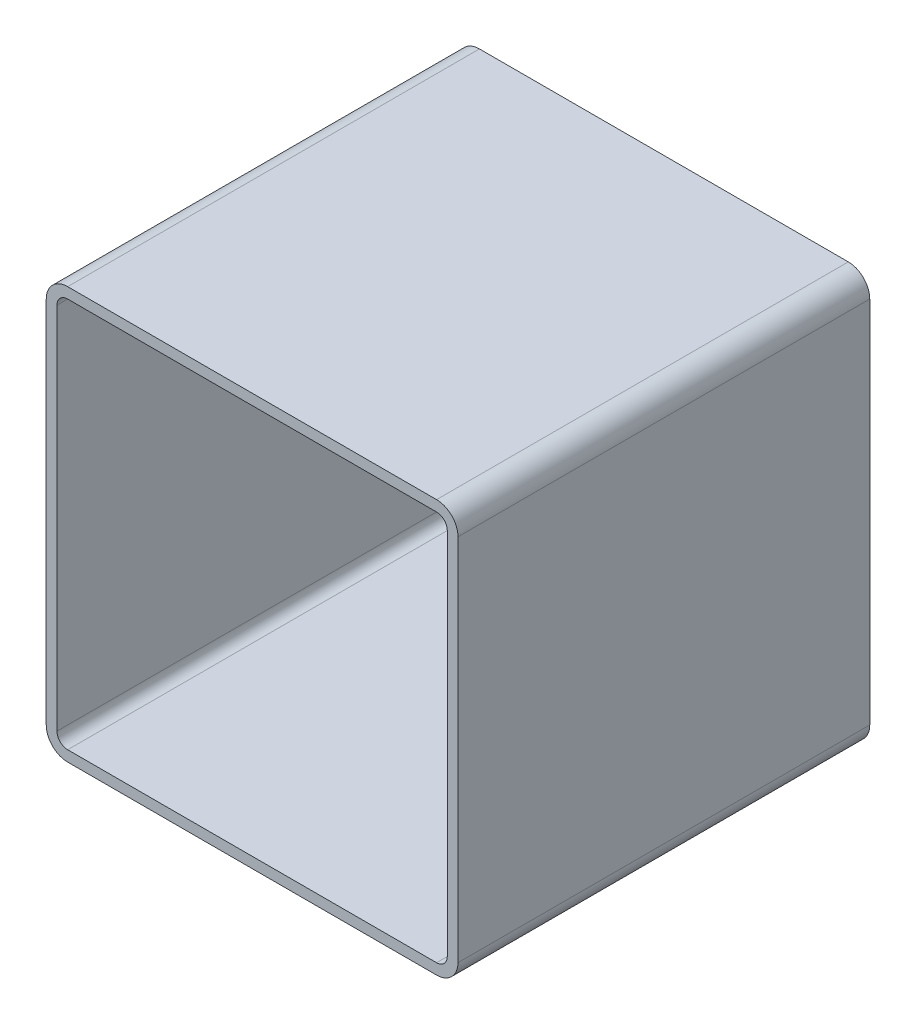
ISO-10303-21;
HEADER;
FILE_DESCRIPTION(('STEP AP214'),'2;1');
FILE_NAME('part.step','',(''),(''),'','','');
FILE_SCHEMA(('AUTOMOTIVE_DESIGN { 1 0 10303 214 1 1 1 1 }'));
ENDSEC;
DATA;
#1=APPLICATION_CONTEXT('core data for automotive mechanical design processes');
#2=APPLICATION_PROTOCOL_DEFINITION('international standard','automotive_design',2000,#1);
#3=PRODUCT_CONTEXT('',#1,'mechanical');
#4=PRODUCT('Part','Part','',(#3));
#5=PRODUCT_RELATED_PRODUCT_CATEGORY('part','',(#4));
#6=PRODUCT_DEFINITION_FORMATION('','',#4);
#7=PRODUCT_DEFINITION_CONTEXT('part definition',#1,'design');
#8=PRODUCT_DEFINITION('design','',#6,#7);
#9=PRODUCT_DEFINITION_SHAPE('','',#8);
#10=(LENGTH_UNIT() NAMED_UNIT(*) SI_UNIT(.MILLI.,.METRE.));
#11=(NAMED_UNIT(*) PLANE_ANGLE_UNIT() SI_UNIT($,.RADIAN.));
#12=(NAMED_UNIT(*) SI_UNIT($,.STERADIAN.) SOLID_ANGLE_UNIT());
#13=UNCERTAINTY_MEASURE_WITH_UNIT(LENGTH_MEASURE(1.E-05),#10,'distance_accuracy_value','');
#14=(GEOMETRIC_REPRESENTATION_CONTEXT(3) GLOBAL_UNCERTAINTY_ASSIGNED_CONTEXT((#13)) GLOBAL_UNIT_ASSIGNED_CONTEXT((#10,
#11,#12)) REPRESENTATION_CONTEXT('',''));
#15=CARTESIAN_POINT('',(0.,0.,0.));
#16=DIRECTION('',(0.,0.,1.));
#17=DIRECTION('',(1.,0.,0.));
#18=AXIS2_PLACEMENT_3D('',#15,#16,#17);
#19=CARTESIAN_POINT('',(16.9817030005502,290.799496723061,304.8));
#20=DIRECTION('',(0.,0.,1.));
#21=DIRECTION('',(1.,0.,0.));
#22=AXIS2_PLACEMENT_3D('',#19,#20,#21);
#23=PLANE('',#22);
#24=CARTESIAN_POINT('',(16.9817030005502,290.799496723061,304.8));
#25=DIRECTION('',(0.,0.,1.));
#26=DIRECTION('',(1.,0.,0.));
#27=AXIS2_PLACEMENT_3D('',#24,#25,#26);
#28=CIRCLE('',#27,15.875);
#29=CARTESIAN_POINT('',(16.9817030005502,306.674496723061,304.8));
#30=VERTEX_POINT('',#29);
#31=CARTESIAN_POINT('',(1.10670300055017,290.799496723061,304.8));
#32=VERTEX_POINT('',#31);
#33=EDGE_CURVE('E211',#30,#32,#28,.T.);
#34=ORIENTED_EDGE('',*,*,#33,.T.);
#35=DIRECTION('',(0.,-1.,0.));
#36=VECTOR('',#35,1.);
#37=CARTESIAN_POINT('',(1.10670300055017,17.7494967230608,304.8));
#38=LINE('',#37,#36);
#39=CARTESIAN_POINT('',(1.10670300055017,17.7494967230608,304.8));
#40=VERTEX_POINT('',#39);
#41=EDGE_CURVE('E214',#32,#40,#38,.T.);
#42=ORIENTED_EDGE('',*,*,#41,.T.);
#43=CARTESIAN_POINT('',(16.9817030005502,17.7494967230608,304.8));
#44=DIRECTION('',(0.,0.,1.));
#45=DIRECTION('',(1.,0.,0.));
#46=AXIS2_PLACEMENT_3D('',#43,#44,#45);
#47=CIRCLE('',#46,15.875);
#48=CARTESIAN_POINT('',(16.9817030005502,1.87449672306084,304.8));
#49=VERTEX_POINT('',#48);
#50=EDGE_CURVE('E217',#40,#49,#47,.T.);
#51=ORIENTED_EDGE('',*,*,#50,.T.);
#52=DIRECTION('',(1.,0.,0.));
#53=VECTOR('',#52,1.);
#54=CARTESIAN_POINT('',(290.03170300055,1.87449672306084,304.8));
#55=LINE('',#54,#53);
#56=CARTESIAN_POINT('',(290.03170300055,1.87449672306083,304.8));
#57=VERTEX_POINT('',#56);
#58=EDGE_CURVE('E219',#49,#57,#55,.T.);
#59=ORIENTED_EDGE('',*,*,#58,.T.);
#60=CARTESIAN_POINT('',(290.03170300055,17.7494967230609,304.8));
#61=DIRECTION('',(0.,0.,1.));
#62=DIRECTION('',(1.,0.,0.));
#63=AXIS2_PLACEMENT_3D('',#60,#61,#62);
#64=CIRCLE('',#63,15.875);
#65=CARTESIAN_POINT('',(305.90670300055,17.7494967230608,304.8));
#66=VERTEX_POINT('',#65);
#67=EDGE_CURVE('E221',#57,#66,#64,.T.);
#68=ORIENTED_EDGE('',*,*,#67,.T.);
#69=DIRECTION('',(0.,1.,0.));
#70=VECTOR('',#69,1.);
#71=CARTESIAN_POINT('',(305.90670300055,290.799496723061,304.8));
#72=LINE('',#71,#70);
#73=CARTESIAN_POINT('',(305.90670300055,290.799496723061,304.8));
#74=VERTEX_POINT('',#73);
#75=EDGE_CURVE('E223',#66,#74,#72,.T.);
#76=ORIENTED_EDGE('',*,*,#75,.T.);
#77=CARTESIAN_POINT('',(290.03170300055,290.799496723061,304.8));
#78=DIRECTION('',(0.,0.,1.));
#79=DIRECTION('',(1.,0.,0.));
#80=AXIS2_PLACEMENT_3D('',#77,#78,#79);
#81=CIRCLE('',#80,15.875);
#82=CARTESIAN_POINT('',(290.03170300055,306.674496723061,304.8));
#83=VERTEX_POINT('',#82);
#84=EDGE_CURVE('E225',#74,#83,#81,.T.);
#85=ORIENTED_EDGE('',*,*,#84,.T.);
#86=DIRECTION('',(-1.,0.,0.));
#87=VECTOR('',#86,1.);
#88=CARTESIAN_POINT('',(16.9817030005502,306.674496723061,304.8));
#89=LINE('',#88,#87);
#90=EDGE_CURVE('E227',#83,#30,#89,.T.);
#91=ORIENTED_EDGE('',*,*,#90,.T.);
#92=EDGE_LOOP('',(#34,#42,#51,#59,#68,#76,#85,#91));
#93=FACE_BOUND('',#92,.T.);
#94=DIRECTION('',(0.,-1.,0.));
#95=VECTOR('',#94,1.);
#96=CARTESIAN_POINT('',(9.04420300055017,17.7494967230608,304.8));
#97=LINE('',#96,#95);
#98=CARTESIAN_POINT('',(9.04420300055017,290.799496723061,304.8));
#99=VERTEX_POINT('',#98);
#100=CARTESIAN_POINT('',(9.04420300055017,17.7494967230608,304.8));
#101=VERTEX_POINT('',#100);
#102=EDGE_CURVE('E154',#99,#101,#97,.T.);
#103=ORIENTED_EDGE('',*,*,#102,.F.);
#104=CARTESIAN_POINT('',(16.9817030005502,290.799496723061,304.8));
#105=DIRECTION('',(0.,0.,1.));
#106=DIRECTION('',(1.,0.,0.));
#107=AXIS2_PLACEMENT_3D('',#104,#105,#106);
#108=CIRCLE('',#107,7.9375);
#109=CARTESIAN_POINT('',(16.9817030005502,298.736996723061,304.8));
#110=VERTEX_POINT('',#109);
#111=EDGE_CURVE('E146',#110,#99,#108,.T.);
#112=ORIENTED_EDGE('',*,*,#111,.F.);
#113=DIRECTION('',(-1.,0.,0.));
#114=VECTOR('',#113,1.);
#115=CARTESIAN_POINT('',(16.9817030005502,298.736996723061,304.8));
#116=LINE('',#115,#114);
#117=CARTESIAN_POINT('',(290.03170300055,298.736996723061,304.8));
#118=VERTEX_POINT('',#117);
#119=EDGE_CURVE('E179',#118,#110,#116,.T.);
#120=ORIENTED_EDGE('',*,*,#119,.F.);
#121=CARTESIAN_POINT('',(290.03170300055,290.799496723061,304.8));
#122=DIRECTION('',(0.,0.,1.));
#123=DIRECTION('',(1.,0.,0.));
#124=AXIS2_PLACEMENT_3D('',#121,#122,#123);
#125=CIRCLE('',#124,7.93750000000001);
#126=CARTESIAN_POINT('',(297.96920300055,290.799496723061,304.8));
#127=VERTEX_POINT('',#126);
#128=EDGE_CURVE('E177',#127,#118,#125,.T.);
#129=ORIENTED_EDGE('',*,*,#128,.F.);
#130=DIRECTION('',(0.,1.,0.));
#131=VECTOR('',#130,1.);
#132=CARTESIAN_POINT('',(297.96920300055,290.799496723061,304.8));
#133=LINE('',#132,#131);
#134=CARTESIAN_POINT('',(297.96920300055,17.7494967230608,304.8));
#135=VERTEX_POINT('',#134);
#136=EDGE_CURVE('E175',#135,#127,#133,.T.);
#137=ORIENTED_EDGE('',*,*,#136,.F.);
#138=CARTESIAN_POINT('',(290.03170300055,17.7494967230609,304.8));
#139=DIRECTION('',(0.,0.,1.));
#140=DIRECTION('',(1.,0.,0.));
#141=AXIS2_PLACEMENT_3D('',#138,#139,#140);
#142=CIRCLE('',#141,7.93750000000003);
#143=CARTESIAN_POINT('',(290.03170300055,9.81199672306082,304.8));
#144=VERTEX_POINT('',#143);
#145=EDGE_CURVE('E173',#144,#135,#142,.T.);
#146=ORIENTED_EDGE('',*,*,#145,.F.);
#147=DIRECTION('',(1.,0.,0.));
#148=VECTOR('',#147,1.);
#149=CARTESIAN_POINT('',(290.03170300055,9.81199672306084,304.8));
#150=LINE('',#149,#148);
#151=CARTESIAN_POINT('',(16.9817030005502,9.81199672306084,304.8));
#152=VERTEX_POINT('',#151);
#153=EDGE_CURVE('E169',#152,#144,#150,.T.);
#154=ORIENTED_EDGE('',*,*,#153,.F.);
#155=CARTESIAN_POINT('',(16.9817030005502,17.7494967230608,304.8));
#156=DIRECTION('',(0.,0.,1.));
#157=DIRECTION('',(1.,0.,0.));
#158=AXIS2_PLACEMENT_3D('',#155,#156,#157);
#159=CIRCLE('',#158,7.9375);
#160=EDGE_CURVE('E167',#101,#152,#159,.T.);
#161=ORIENTED_EDGE('',*,*,#160,.F.);
#162=EDGE_LOOP('',(#103,#112,#120,#129,#137,#146,#154,#161));
#163=FACE_BOUND('',#162,.T.);
#164=ADVANCED_FACE('F33',(#93,#163),#23,.T.);
#165=CARTESIAN_POINT('',(16.9817030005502,290.799496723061,0.));
#166=DIRECTION('',(0.,0.,1.));
#167=DIRECTION('',(1.,0.,0.));
#168=AXIS2_PLACEMENT_3D('',#165,#166,#167);
#169=PLANE('',#168);
#170=CARTESIAN_POINT('',(16.9817030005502,290.799496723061,0.));
#171=DIRECTION('',(0.,0.,1.));
#172=DIRECTION('',(1.,0.,0.));
#173=AXIS2_PLACEMENT_3D('',#170,#171,#172);
#174=CIRCLE('',#173,15.875);
#175=CARTESIAN_POINT('',(16.9817030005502,306.674496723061,0.));
#176=VERTEX_POINT('',#175);
#177=CARTESIAN_POINT('',(1.10670300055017,290.799496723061,0.));
#178=VERTEX_POINT('',#177);
#179=EDGE_CURVE('E162',#176,#178,#174,.T.);
#180=ORIENTED_EDGE('',*,*,#179,.F.);
#181=DIRECTION('',(-1.,0.,0.));
#182=VECTOR('',#181,1.);
#183=CARTESIAN_POINT('',(16.9817030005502,306.674496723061,0.));
#184=LINE('',#183,#182);
#185=CARTESIAN_POINT('',(290.03170300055,306.674496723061,0.));
#186=VERTEX_POINT('',#185);
#187=EDGE_CURVE('E215',#186,#176,#184,.T.);
#188=ORIENTED_EDGE('',*,*,#187,.F.);
#189=CARTESIAN_POINT('',(290.03170300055,290.799496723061,0.));
#190=DIRECTION('',(0.,0.,1.));
#191=DIRECTION('',(1.,0.,0.));
#192=AXIS2_PLACEMENT_3D('',#189,#190,#191);
#193=CIRCLE('',#192,15.875);
#194=CARTESIAN_POINT('',(305.90670300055,290.799496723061,0.));
#195=VERTEX_POINT('',#194);
#196=EDGE_CURVE('E242',#195,#186,#193,.T.);
#197=ORIENTED_EDGE('',*,*,#196,.F.);
#198=DIRECTION('',(0.,1.,0.));
#199=VECTOR('',#198,1.);
#200=CARTESIAN_POINT('',(305.90670300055,290.799496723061,0.));
#201=LINE('',#200,#199);
#202=CARTESIAN_POINT('',(305.90670300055,17.7494967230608,0.));
#203=VERTEX_POINT('',#202);
#204=EDGE_CURVE('E240',#203,#195,#201,.T.);
#205=ORIENTED_EDGE('',*,*,#204,.F.);
#206=CARTESIAN_POINT('',(290.03170300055,17.7494967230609,0.));
#207=DIRECTION('',(0.,0.,1.));
#208=DIRECTION('',(1.,0.,0.));
#209=AXIS2_PLACEMENT_3D('',#206,#207,#208);
#210=CIRCLE('',#209,15.875);
#211=CARTESIAN_POINT('',(290.03170300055,1.87449672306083,0.));
#212=VERTEX_POINT('',#211);
#213=EDGE_CURVE('E238',#212,#203,#210,.T.);
#214=ORIENTED_EDGE('',*,*,#213,.F.);
#215=DIRECTION('',(1.,0.,0.));
#216=VECTOR('',#215,1.);
#217=CARTESIAN_POINT('',(290.03170300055,1.87449672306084,0.));
#218=LINE('',#217,#216);
#219=CARTESIAN_POINT('',(16.9817030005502,1.87449672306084,0.));
#220=VERTEX_POINT('',#219);
#221=EDGE_CURVE('E236',#220,#212,#218,.T.);
#222=ORIENTED_EDGE('',*,*,#221,.F.);
#223=CARTESIAN_POINT('',(16.9817030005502,17.7494967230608,0.));
#224=DIRECTION('',(0.,0.,1.));
#225=DIRECTION('',(1.,0.,0.));
#226=AXIS2_PLACEMENT_3D('',#223,#224,#225);
#227=CIRCLE('',#226,15.875);
#228=CARTESIAN_POINT('',(1.10670300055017,17.7494967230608,0.));
#229=VERTEX_POINT('',#228);
#230=EDGE_CURVE('E234',#229,#220,#227,.T.);
#231=ORIENTED_EDGE('',*,*,#230,.F.);
#232=DIRECTION('',(0.,-1.,0.));
#233=VECTOR('',#232,1.);
#234=CARTESIAN_POINT('',(1.10670300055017,17.7494967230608,0.));
#235=LINE('',#234,#233);
#236=EDGE_CURVE('E232',#178,#229,#235,.T.);
#237=ORIENTED_EDGE('',*,*,#236,.F.);
#238=EDGE_LOOP('',(#180,#188,#197,#205,#214,#222,#231,#237));
#239=FACE_BOUND('',#238,.T.);
#240=CARTESIAN_POINT('',(16.9817030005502,290.799496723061,0.));
#241=DIRECTION('',(0.,0.,1.));
#242=DIRECTION('',(1.,0.,0.));
#243=AXIS2_PLACEMENT_3D('',#240,#241,#242);
#244=CIRCLE('',#243,7.9375);
#245=CARTESIAN_POINT('',(16.9817030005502,298.736996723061,0.));
#246=VERTEX_POINT('',#245);
#247=CARTESIAN_POINT('',(9.04420300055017,290.799496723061,0.));
#248=VERTEX_POINT('',#247);
#249=EDGE_CURVE('E56',#246,#248,#244,.T.);
#250=ORIENTED_EDGE('',*,*,#249,.T.);
#251=DIRECTION('',(0.,-1.,0.));
#252=VECTOR('',#251,1.);
#253=CARTESIAN_POINT('',(9.04420300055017,17.7494967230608,0.));
#254=LINE('',#253,#252);
#255=CARTESIAN_POINT('',(9.04420300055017,17.7494967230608,0.));
#256=VERTEX_POINT('',#255);
#257=EDGE_CURVE('E161',#248,#256,#254,.T.);
#258=ORIENTED_EDGE('',*,*,#257,.T.);
#259=CARTESIAN_POINT('',(16.9817030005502,17.7494967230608,0.));
#260=DIRECTION('',(0.,0.,1.));
#261=DIRECTION('',(1.,0.,0.));
#262=AXIS2_PLACEMENT_3D('',#259,#260,#261);
#263=CIRCLE('',#262,7.9375);
#264=CARTESIAN_POINT('',(16.9817030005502,9.81199672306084,0.));
#265=VERTEX_POINT('',#264);
#266=EDGE_CURVE('E183',#256,#265,#263,.T.);
#267=ORIENTED_EDGE('',*,*,#266,.T.);
#268=DIRECTION('',(1.,0.,0.));
#269=VECTOR('',#268,1.);
#270=CARTESIAN_POINT('',(290.03170300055,9.81199672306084,0.));
#271=LINE('',#270,#269);
#272=CARTESIAN_POINT('',(290.03170300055,9.81199672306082,0.));
#273=VERTEX_POINT('',#272);
#274=EDGE_CURVE('E186',#265,#273,#271,.T.);
#275=ORIENTED_EDGE('',*,*,#274,.T.);
#276=CARTESIAN_POINT('',(290.03170300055,17.7494967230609,0.));
#277=DIRECTION('',(0.,0.,1.));
#278=DIRECTION('',(1.,0.,0.));
#279=AXIS2_PLACEMENT_3D('',#276,#277,#278);
#280=CIRCLE('',#279,7.93750000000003);
#281=CARTESIAN_POINT('',(297.96920300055,17.7494967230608,0.));
#282=VERTEX_POINT('',#281);
#283=EDGE_CURVE('E189',#273,#282,#280,.T.);
#284=ORIENTED_EDGE('',*,*,#283,.T.);
#285=DIRECTION('',(0.,1.,0.));
#286=VECTOR('',#285,1.);
#287=CARTESIAN_POINT('',(297.96920300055,290.799496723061,0.));
#288=LINE('',#287,#286);
#289=CARTESIAN_POINT('',(297.96920300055,290.799496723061,0.));
#290=VERTEX_POINT('',#289);
#291=EDGE_CURVE('E192',#282,#290,#288,.T.);
#292=ORIENTED_EDGE('',*,*,#291,.T.);
#293=CARTESIAN_POINT('',(290.03170300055,290.799496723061,0.));
#294=DIRECTION('',(0.,0.,1.));
#295=DIRECTION('',(1.,0.,0.));
#296=AXIS2_PLACEMENT_3D('',#293,#294,#295);
#297=CIRCLE('',#296,7.93750000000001);
#298=CARTESIAN_POINT('',(290.03170300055,298.736996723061,0.));
#299=VERTEX_POINT('',#298);
#300=EDGE_CURVE('E195',#290,#299,#297,.T.);
#301=ORIENTED_EDGE('',*,*,#300,.T.);
#302=DIRECTION('',(-1.,0.,0.));
#303=VECTOR('',#302,1.);
#304=CARTESIAN_POINT('',(16.9817030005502,298.736996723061,0.));
#305=LINE('',#304,#303);
#306=EDGE_CURVE('E155',#299,#246,#305,.T.);
#307=ORIENTED_EDGE('',*,*,#306,.T.);
#308=EDGE_LOOP('',(#250,#258,#267,#275,#284,#292,#301,#307));
#309=FACE_BOUND('',#308,.T.);
#310=ADVANCED_FACE('F272',(#239,#309),#169,.F.);
#311=CARTESIAN_POINT('',(16.9817030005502,290.799496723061,304.8));
#312=DIRECTION('',(0.,0.,-1.));
#313=DIRECTION('',(-1.,0.,0.));
#314=AXIS2_PLACEMENT_3D('',#311,#312,#313);
#315=CYLINDRICAL_SURFACE('',#314,15.875);
#316=ORIENTED_EDGE('',*,*,#179,.T.);
#317=DIRECTION('',(0.,0.,-1.));
#318=VECTOR('',#317,1.);
#319=CARTESIAN_POINT('',(1.10670300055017,290.799496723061,304.8));
#320=LINE('',#319,#318);
#321=EDGE_CURVE('E11',#32,#178,#320,.T.);
#322=ORIENTED_EDGE('',*,*,#321,.F.);
#323=ORIENTED_EDGE('',*,*,#33,.F.);
#324=DIRECTION('',(0.,0.,-1.));
#325=VECTOR('',#324,1.);
#326=CARTESIAN_POINT('',(16.9817030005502,306.674496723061,304.8));
#327=LINE('',#326,#325);
#328=EDGE_CURVE('E229',#30,#176,#327,.T.);
#329=ORIENTED_EDGE('',*,*,#328,.T.);
#330=EDGE_LOOP('',(#316,#322,#323,#329));
#331=FACE_BOUND('',#330,.T.);
#332=ADVANCED_FACE('F35',(#331),#315,.T.);
#333=CARTESIAN_POINT('',(1.10670300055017,17.7494967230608,304.8));
#334=DIRECTION('',(1.,0.,0.));
#335=DIRECTION('',(0.,0.,-1.));
#336=AXIS2_PLACEMENT_3D('',#333,#334,#335);
#337=PLANE('',#336);
#338=ORIENTED_EDGE('',*,*,#236,.T.);
#339=DIRECTION('',(0.,0.,-1.));
#340=VECTOR('',#339,1.);
#341=CARTESIAN_POINT('',(1.10670300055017,17.7494967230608,304.8));
#342=LINE('',#341,#340);
#343=EDGE_CURVE('E41',#40,#229,#342,.T.);
#344=ORIENTED_EDGE('',*,*,#343,.F.);
#345=ORIENTED_EDGE('',*,*,#41,.F.);
#346=ORIENTED_EDGE('',*,*,#321,.T.);
#347=EDGE_LOOP('',(#338,#344,#345,#346));
#348=FACE_BOUND('',#347,.T.);
#349=ADVANCED_FACE('F289',(#348),#337,.F.);
#350=CARTESIAN_POINT('',(16.9817030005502,17.7494967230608,304.8));
#351=DIRECTION('',(0.,0.,-1.));
#352=DIRECTION('',(-1.,0.,0.));
#353=AXIS2_PLACEMENT_3D('',#350,#351,#352);
#354=CYLINDRICAL_SURFACE('',#353,15.875);
#355=ORIENTED_EDGE('',*,*,#230,.T.);
#356=DIRECTION('',(0.,0.,-1.));
#357=VECTOR('',#356,1.);
#358=CARTESIAN_POINT('',(16.9817030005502,1.87449672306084,304.8));
#359=LINE('',#358,#357);
#360=EDGE_CURVE('E259',#49,#220,#359,.T.);
#361=ORIENTED_EDGE('',*,*,#360,.F.);
#362=ORIENTED_EDGE('',*,*,#50,.F.);
#363=ORIENTED_EDGE('',*,*,#343,.T.);
#364=EDGE_LOOP('',(#355,#361,#362,#363));
#365=FACE_BOUND('',#364,.T.);
#366=ADVANCED_FACE('F266',(#365),#354,.T.);
#367=CARTESIAN_POINT('',(290.03170300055,1.87449672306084,304.8));
#368=DIRECTION('',(0.,1.,0.));
#369=DIRECTION('',(0.,0.,1.));
#370=AXIS2_PLACEMENT_3D('',#367,#368,#369);
#371=PLANE('',#370);
#372=ORIENTED_EDGE('',*,*,#221,.T.);
#373=DIRECTION('',(0.,0.,-1.));
#374=VECTOR('',#373,1.);
#375=CARTESIAN_POINT('',(290.03170300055,1.87449672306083,304.8));
#376=LINE('',#375,#374);
#377=EDGE_CURVE('E256',#57,#212,#376,.T.);
#378=ORIENTED_EDGE('',*,*,#377,.F.);
#379=ORIENTED_EDGE('',*,*,#58,.F.);
#380=ORIENTED_EDGE('',*,*,#360,.T.);
#381=EDGE_LOOP('',(#372,#378,#379,#380));
#382=FACE_BOUND('',#381,.T.);
#383=ADVANCED_FACE('F278',(#382),#371,.F.);
#384=CARTESIAN_POINT('',(290.03170300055,17.7494967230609,304.8));
#385=DIRECTION('',(0.,0.,-1.));
#386=DIRECTION('',(-1.,0.,0.));
#387=AXIS2_PLACEMENT_3D('',#384,#385,#386);
#388=CYLINDRICAL_SURFACE('',#387,15.875);
#389=ORIENTED_EDGE('',*,*,#213,.T.);
#390=DIRECTION('',(0.,0.,-1.));
#391=VECTOR('',#390,1.);
#392=CARTESIAN_POINT('',(305.90670300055,17.7494967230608,304.8));
#393=LINE('',#392,#391);
#394=EDGE_CURVE('E253',#66,#203,#393,.T.);
#395=ORIENTED_EDGE('',*,*,#394,.F.);
#396=ORIENTED_EDGE('',*,*,#67,.F.);
#397=ORIENTED_EDGE('',*,*,#377,.T.);
#398=EDGE_LOOP('',(#389,#395,#396,#397));
#399=FACE_BOUND('',#398,.T.);
#400=ADVANCED_FACE('F282',(#399),#388,.T.);
#401=CARTESIAN_POINT('',(305.90670300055,290.799496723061,304.8));
#402=DIRECTION('',(-1.,0.,0.));
#403=DIRECTION('',(0.,0.,1.));
#404=AXIS2_PLACEMENT_3D('',#401,#402,#403);
#405=PLANE('',#404);
#406=ORIENTED_EDGE('',*,*,#204,.T.);
#407=DIRECTION('',(0.,0.,-1.));
#408=VECTOR('',#407,1.);
#409=CARTESIAN_POINT('',(305.90670300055,290.799496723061,304.8));
#410=LINE('',#409,#408);
#411=EDGE_CURVE('E250',#74,#195,#410,.T.);
#412=ORIENTED_EDGE('',*,*,#411,.F.);
#413=ORIENTED_EDGE('',*,*,#75,.F.);
#414=ORIENTED_EDGE('',*,*,#394,.T.);
#415=EDGE_LOOP('',(#406,#412,#413,#414));
#416=FACE_BOUND('',#415,.T.);
#417=ADVANCED_FACE('F302',(#416),#405,.F.);
#418=CARTESIAN_POINT('',(290.03170300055,290.799496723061,304.8));
#419=DIRECTION('',(0.,0.,-1.));
#420=DIRECTION('',(-1.,0.,0.));
#421=AXIS2_PLACEMENT_3D('',#418,#419,#420);
#422=CYLINDRICAL_SURFACE('',#421,15.875);
#423=ORIENTED_EDGE('',*,*,#196,.T.);
#424=DIRECTION('',(0.,0.,-1.));
#425=VECTOR('',#424,1.);
#426=CARTESIAN_POINT('',(290.03170300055,306.674496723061,304.8));
#427=LINE('',#426,#425);
#428=EDGE_CURVE('E247',#83,#186,#427,.T.);
#429=ORIENTED_EDGE('',*,*,#428,.F.);
#430=ORIENTED_EDGE('',*,*,#84,.F.);
#431=ORIENTED_EDGE('',*,*,#411,.T.);
#432=EDGE_LOOP('',(#423,#429,#430,#431));
#433=FACE_BOUND('',#432,.T.);
#434=ADVANCED_FACE('F300',(#433),#422,.T.);
#435=CARTESIAN_POINT('',(16.9817030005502,306.674496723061,304.8));
#436=DIRECTION('',(0.,-1.,0.));
#437=DIRECTION('',(0.,0.,-1.));
#438=AXIS2_PLACEMENT_3D('',#435,#436,#437);
#439=PLANE('',#438);
#440=ORIENTED_EDGE('',*,*,#187,.T.);
#441=ORIENTED_EDGE('',*,*,#328,.F.);
#442=ORIENTED_EDGE('',*,*,#90,.F.);
#443=ORIENTED_EDGE('',*,*,#428,.T.);
#444=EDGE_LOOP('',(#440,#441,#442,#443));
#445=FACE_BOUND('',#444,.T.);
#446=ADVANCED_FACE('F295',(#445),#439,.F.);
#447=CARTESIAN_POINT('',(16.9817030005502,290.799496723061,304.8));
#448=DIRECTION('',(0.,0.,-1.));
#449=DIRECTION('',(-1.,0.,0.));
#450=AXIS2_PLACEMENT_3D('',#447,#448,#449);
#451=CYLINDRICAL_SURFACE('',#450,7.9375);
#452=ORIENTED_EDGE('',*,*,#249,.F.);
#453=DIRECTION('',(0.,0.,-1.));
#454=VECTOR('',#453,1.);
#455=CARTESIAN_POINT('',(16.9817030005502,298.736996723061,304.8));
#456=LINE('',#455,#454);
#457=EDGE_CURVE('E150',#110,#246,#456,.T.);
#458=ORIENTED_EDGE('',*,*,#457,.F.);
#459=ORIENTED_EDGE('',*,*,#111,.T.);
#460=DIRECTION('',(0.,0.,-1.));
#461=VECTOR('',#460,1.);
#462=CARTESIAN_POINT('',(9.04420300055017,290.799496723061,304.8));
#463=LINE('',#462,#461);
#464=EDGE_CURVE('E149',#99,#248,#463,.T.);
#465=ORIENTED_EDGE('',*,*,#464,.T.);
#466=EDGE_LOOP('',(#452,#458,#459,#465));
#467=FACE_BOUND('',#466,.T.);
#468=ADVANCED_FACE('F148',(#467),#451,.F.);
#469=CARTESIAN_POINT('',(9.04420300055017,17.7494967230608,304.8));
#470=DIRECTION('',(1.,0.,0.));
#471=DIRECTION('',(0.,0.,-1.));
#472=AXIS2_PLACEMENT_3D('',#469,#470,#471);
#473=PLANE('',#472);
#474=ORIENTED_EDGE('',*,*,#257,.F.);
#475=ORIENTED_EDGE('',*,*,#464,.F.);
#476=ORIENTED_EDGE('',*,*,#102,.T.);
#477=DIRECTION('',(0.,0.,-1.));
#478=VECTOR('',#477,1.);
#479=CARTESIAN_POINT('',(9.04420300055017,17.7494967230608,304.8));
#480=LINE('',#479,#478);
#481=EDGE_CURVE('E163',#101,#256,#480,.T.);
#482=ORIENTED_EDGE('',*,*,#481,.T.);
#483=EDGE_LOOP('',(#474,#475,#476,#482));
#484=FACE_BOUND('',#483,.T.);
#485=ADVANCED_FACE('F158',(#484),#473,.T.);
#486=CARTESIAN_POINT('',(16.9817030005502,17.7494967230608,304.8));
#487=DIRECTION('',(0.,0.,-1.));
#488=DIRECTION('',(-1.,0.,0.));
#489=AXIS2_PLACEMENT_3D('',#486,#487,#488);
#490=CYLINDRICAL_SURFACE('',#489,7.9375);
#491=ORIENTED_EDGE('',*,*,#266,.F.);
#492=ORIENTED_EDGE('',*,*,#481,.F.);
#493=ORIENTED_EDGE('',*,*,#160,.T.);
#494=DIRECTION('',(0.,0.,-1.));
#495=VECTOR('',#494,1.);
#496=CARTESIAN_POINT('',(16.9817030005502,9.81199672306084,304.8));
#497=LINE('',#496,#495);
#498=EDGE_CURVE('E208',#152,#265,#497,.T.);
#499=ORIENTED_EDGE('',*,*,#498,.T.);
#500=EDGE_LOOP('',(#491,#492,#493,#499));
#501=FACE_BOUND('',#500,.T.);
#502=ADVANCED_FACE('F327',(#501),#490,.F.);
#503=CARTESIAN_POINT('',(290.03170300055,9.81199672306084,304.8));
#504=DIRECTION('',(0.,1.,0.));
#505=DIRECTION('',(0.,0.,1.));
#506=AXIS2_PLACEMENT_3D('',#503,#504,#505);
#507=PLANE('',#506);
#508=ORIENTED_EDGE('',*,*,#274,.F.);
#509=ORIENTED_EDGE('',*,*,#498,.F.);
#510=ORIENTED_EDGE('',*,*,#153,.T.);
#511=DIRECTION('',(0.,0.,-1.));
#512=VECTOR('',#511,1.);
#513=CARTESIAN_POINT('',(290.03170300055,9.81199672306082,304.8));
#514=LINE('',#513,#512);
#515=EDGE_CURVE('E206',#144,#273,#514,.T.);
#516=ORIENTED_EDGE('',*,*,#515,.T.);
#517=EDGE_LOOP('',(#508,#509,#510,#516));
#518=FACE_BOUND('',#517,.T.);
#519=ADVANCED_FACE('F331',(#518),#507,.T.);
#520=CARTESIAN_POINT('',(290.03170300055,17.7494967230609,304.8));
#521=DIRECTION('',(0.,0.,-1.));
#522=DIRECTION('',(-1.,0.,0.));
#523=AXIS2_PLACEMENT_3D('',#520,#521,#522);
#524=CYLINDRICAL_SURFACE('',#523,7.93750000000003);
#525=ORIENTED_EDGE('',*,*,#283,.F.);
#526=ORIENTED_EDGE('',*,*,#515,.F.);
#527=ORIENTED_EDGE('',*,*,#145,.T.);
#528=DIRECTION('',(0.,0.,-1.));
#529=VECTOR('',#528,1.);
#530=CARTESIAN_POINT('',(297.96920300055,17.7494967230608,304.8));
#531=LINE('',#530,#529);
#532=EDGE_CURVE('E204',#135,#282,#531,.T.);
#533=ORIENTED_EDGE('',*,*,#532,.T.);
#534=EDGE_LOOP('',(#525,#526,#527,#533));
#535=FACE_BOUND('',#534,.T.);
#536=ADVANCED_FACE('F337',(#535),#524,.F.);
#537=CARTESIAN_POINT('',(297.96920300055,290.799496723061,304.8));
#538=DIRECTION('',(-1.,0.,0.));
#539=DIRECTION('',(0.,0.,1.));
#540=AXIS2_PLACEMENT_3D('',#537,#538,#539);
#541=PLANE('',#540);
#542=ORIENTED_EDGE('',*,*,#291,.F.);
#543=ORIENTED_EDGE('',*,*,#532,.F.);
#544=ORIENTED_EDGE('',*,*,#136,.T.);
#545=DIRECTION('',(0.,0.,-1.));
#546=VECTOR('',#545,1.);
#547=CARTESIAN_POINT('',(297.96920300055,290.799496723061,304.8));
#548=LINE('',#547,#546);
#549=EDGE_CURVE('E202',#127,#290,#548,.T.);
#550=ORIENTED_EDGE('',*,*,#549,.T.);
#551=EDGE_LOOP('',(#542,#543,#544,#550));
#552=FACE_BOUND('',#551,.T.);
#553=ADVANCED_FACE('F341',(#552),#541,.T.);
#554=CARTESIAN_POINT('',(290.03170300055,290.799496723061,304.8));
#555=DIRECTION('',(0.,0.,-1.));
#556=DIRECTION('',(-1.,0.,0.));
#557=AXIS2_PLACEMENT_3D('',#554,#555,#556);
#558=CYLINDRICAL_SURFACE('',#557,7.93750000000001);
#559=ORIENTED_EDGE('',*,*,#300,.F.);
#560=ORIENTED_EDGE('',*,*,#549,.F.);
#561=ORIENTED_EDGE('',*,*,#128,.T.);
#562=DIRECTION('',(0.,0.,-1.));
#563=VECTOR('',#562,1.);
#564=CARTESIAN_POINT('',(290.03170300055,298.736996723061,304.8));
#565=LINE('',#564,#563);
#566=EDGE_CURVE('E48',#118,#299,#565,.T.);
#567=ORIENTED_EDGE('',*,*,#566,.T.);
#568=EDGE_LOOP('',(#559,#560,#561,#567));
#569=FACE_BOUND('',#568,.T.);
#570=ADVANCED_FACE('F345',(#569),#558,.F.);
#571=CARTESIAN_POINT('',(16.9817030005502,298.736996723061,304.8));
#572=DIRECTION('',(0.,-1.,0.));
#573=DIRECTION('',(0.,0.,-1.));
#574=AXIS2_PLACEMENT_3D('',#571,#572,#573);
#575=PLANE('',#574);
#576=ORIENTED_EDGE('',*,*,#306,.F.);
#577=ORIENTED_EDGE('',*,*,#566,.F.);
#578=ORIENTED_EDGE('',*,*,#119,.T.);
#579=ORIENTED_EDGE('',*,*,#457,.T.);
#580=EDGE_LOOP('',(#576,#577,#578,#579));
#581=FACE_BOUND('',#580,.T.);
#582=ADVANCED_FACE('F349',(#581),#575,.T.);
#583=CLOSED_SHELL('',(#164,#310,#332,#349,#366,#383,#400,#417,#434,#446,#468,#485,#502,#519,
#536,#553,#570,#582));
#584=MANIFOLD_SOLID_BREP('B2',#583);
#585=ADVANCED_BREP_SHAPE_REPRESENTATION('',(#18,#584),#14);
#586=SHAPE_DEFINITION_REPRESENTATION(#9,#585);
ENDSEC;
END-ISO-10303-21;
